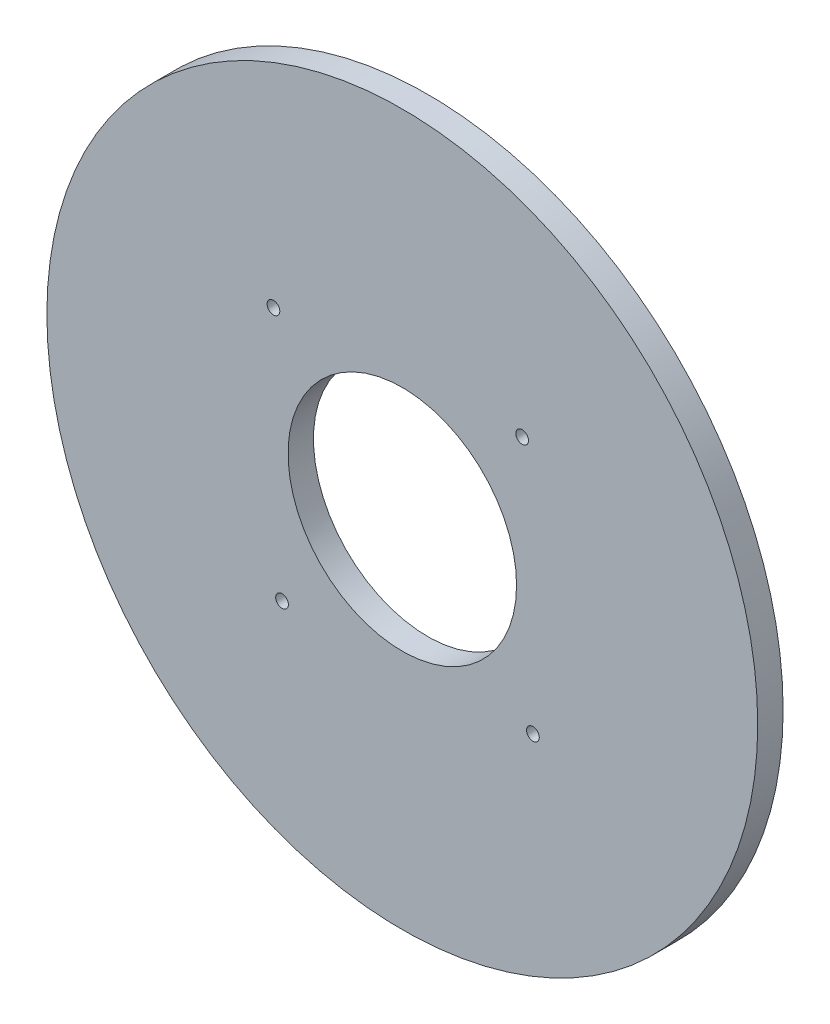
ISO-10303-21;
HEADER;
FILE_DESCRIPTION(('STEP AP214'),'2;1');
FILE_NAME('part.step','',(''),(''),'','','');
FILE_SCHEMA(('AUTOMOTIVE_DESIGN { 1 0 10303 214 1 1 1 1 }'));
ENDSEC;
DATA;
#1=APPLICATION_CONTEXT('core data for automotive mechanical design processes');
#2=APPLICATION_PROTOCOL_DEFINITION('international standard','automotive_design',2000,#1);
#3=PRODUCT_CONTEXT('',#1,'mechanical');
#4=PRODUCT('Part','Part','',(#3));
#5=PRODUCT_RELATED_PRODUCT_CATEGORY('part','',(#4));
#6=PRODUCT_DEFINITION_FORMATION('','',#4);
#7=PRODUCT_DEFINITION_CONTEXT('part definition',#1,'design');
#8=PRODUCT_DEFINITION('design','',#6,#7);
#9=PRODUCT_DEFINITION_SHAPE('','',#8);
#10=(LENGTH_UNIT() NAMED_UNIT(*) SI_UNIT(.MILLI.,.METRE.));
#11=(NAMED_UNIT(*) PLANE_ANGLE_UNIT() SI_UNIT($,.RADIAN.));
#12=(NAMED_UNIT(*) SI_UNIT($,.STERADIAN.) SOLID_ANGLE_UNIT());
#13=UNCERTAINTY_MEASURE_WITH_UNIT(LENGTH_MEASURE(1.E-05),#10,'distance_accuracy_value','');
#14=(GEOMETRIC_REPRESENTATION_CONTEXT(3) GLOBAL_UNCERTAINTY_ASSIGNED_CONTEXT((#13)) GLOBAL_UNIT_ASSIGNED_CONTEXT((#10,
#11,#12)) REPRESENTATION_CONTEXT('',''));
#15=CARTESIAN_POINT('',(0.,0.,0.));
#16=DIRECTION('',(0.,0.,1.));
#17=DIRECTION('',(1.,0.,0.));
#18=AXIS2_PLACEMENT_3D('',#15,#16,#17);
#19=CARTESIAN_POINT('',(0.,0.,6.35));
#20=DIRECTION('',(0.,0.,-1.));
#21=DIRECTION('',(-1.,0.,0.));
#22=AXIS2_PLACEMENT_3D('',#19,#20,#21);
#23=CYLINDRICAL_SURFACE('',#22,88.9);
#24=CARTESIAN_POINT('',(0.,0.,6.35));
#25=DIRECTION('',(0.,0.,1.));
#26=DIRECTION('',(1.,0.,0.));
#27=AXIS2_PLACEMENT_3D('',#24,#25,#26);
#28=CIRCLE('',#27,88.9);
#29=CARTESIAN_POINT('',(88.9,0.,6.35));
#30=VERTEX_POINT('',#29);
#31=EDGE_CURVE('E10',#30,#30,#28,.T.);
#32=ORIENTED_EDGE('',*,*,#31,.F.);
#33=EDGE_LOOP('',(#32));
#34=FACE_BOUND('',#33,.T.);
#35=CARTESIAN_POINT('',(0.,0.,0.));
#36=DIRECTION('',(0.,0.,1.));
#37=DIRECTION('',(1.,0.,0.));
#38=AXIS2_PLACEMENT_3D('',#35,#36,#37);
#39=CIRCLE('',#38,88.9);
#40=CARTESIAN_POINT('',(88.9,0.,0.));
#41=VERTEX_POINT('',#40);
#42=EDGE_CURVE('E33',#41,#41,#39,.T.);
#43=ORIENTED_EDGE('',*,*,#42,.T.);
#44=EDGE_LOOP('',(#43));
#45=FACE_BOUND('',#44,.T.);
#46=ADVANCED_FACE('F30',(#34,#45),#23,.T.);
#47=CARTESIAN_POINT('',(0.,0.,6.35));
#48=DIRECTION('',(0.,0.,1.));
#49=DIRECTION('',(1.,0.,0.));
#50=AXIS2_PLACEMENT_3D('',#47,#48,#49);
#51=PLANE('',#50);
#52=CARTESIAN_POINT('',(29.9769221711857,32.8205215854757,6.35));
#53=DIRECTION('',(0.,0.,-1.));
#54=DIRECTION('',(-1.,0.,0.));
#55=AXIS2_PLACEMENT_3D('',#52,#53,#54);
#56=CIRCLE('',#55,1.5875);
#57=CARTESIAN_POINT('',(28.3894221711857,32.8205215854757,6.35));
#58=VERTEX_POINT('',#57);
#59=EDGE_CURVE('E63',#58,#58,#56,.T.);
#60=ORIENTED_EDGE('',*,*,#59,.T.);
#61=EDGE_LOOP('',(#60));
#62=FACE_BOUND('',#61,.T.);
#63=CARTESIAN_POINT('',(32.6738609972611,-30.1367102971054,6.35));
#64=DIRECTION('',(0.,0.,-1.));
#65=DIRECTION('',(-1.,0.,0.));
#66=AXIS2_PLACEMENT_3D('',#63,#64,#65);
#67=CIRCLE('',#66,1.5875);
#68=CARTESIAN_POINT('',(31.0863609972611,-30.1367102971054,6.35));
#69=VERTEX_POINT('',#68);
#70=EDGE_CURVE('E57',#69,#69,#67,.T.);
#71=ORIENTED_EDGE('',*,*,#70,.T.);
#72=EDGE_LOOP('',(#71));
#73=FACE_BOUND('',#72,.T.);
#74=CARTESIAN_POINT('',(-30.0850826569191,-32.7214043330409,6.35));
#75=DIRECTION('',(0.,0.,-1.));
#76=DIRECTION('',(-1.,0.,0.));
#77=AXIS2_PLACEMENT_3D('',#74,#75,#76);
#78=CIRCLE('',#77,1.5875);
#79=CARTESIAN_POINT('',(-31.6725826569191,-32.7214043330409,6.35));
#80=VERTEX_POINT('',#79);
#81=EDGE_CURVE('E51',#80,#80,#78,.T.);
#82=ORIENTED_EDGE('',*,*,#81,.T.);
#83=EDGE_LOOP('',(#82));
#84=FACE_BOUND('',#83,.T.);
#85=CARTESIAN_POINT('',(-32.229029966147,29.7378972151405,6.35));
#86=DIRECTION('',(0.,0.,-1.));
#87=DIRECTION('',(-1.,0.,0.));
#88=AXIS2_PLACEMENT_3D('',#85,#86,#87);
#89=CIRCLE('',#88,1.5875);
#90=CARTESIAN_POINT('',(-33.816529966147,29.7378972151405,6.35));
#91=VERTEX_POINT('',#90);
#92=EDGE_CURVE('E45',#91,#91,#89,.T.);
#93=ORIENTED_EDGE('',*,*,#92,.T.);
#94=EDGE_LOOP('',(#93));
#95=FACE_BOUND('',#94,.T.);
#96=CARTESIAN_POINT('',(0.,0.,6.35));
#97=DIRECTION('',(0.,0.,1.));
#98=DIRECTION('',(1.,0.,0.));
#99=AXIS2_PLACEMENT_3D('',#96,#97,#98);
#100=CIRCLE('',#99,28.575);
#101=CARTESIAN_POINT('',(28.575,0.,6.35));
#102=VERTEX_POINT('',#101);
#103=EDGE_CURVE('E42',#102,#102,#100,.T.);
#104=ORIENTED_EDGE('',*,*,#103,.F.);
#105=EDGE_LOOP('',(#104));
#106=FACE_BOUND('',#105,.T.);
#107=ORIENTED_EDGE('',*,*,#31,.T.);
#108=EDGE_LOOP('',(#107));
#109=FACE_BOUND('',#108,.T.);
#110=ADVANCED_FACE('F72',(#62,#73,#84,#95,#106,#109),#51,.T.);
#111=CARTESIAN_POINT('',(0.,0.,0.));
#112=DIRECTION('',(0.,0.,1.));
#113=DIRECTION('',(1.,0.,0.));
#114=AXIS2_PLACEMENT_3D('',#111,#112,#113);
#115=PLANE('',#114);
#116=CARTESIAN_POINT('',(29.9769221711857,32.8205215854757,0.));
#117=DIRECTION('',(0.,0.,-1.));
#118=DIRECTION('',(-1.,0.,0.));
#119=AXIS2_PLACEMENT_3D('',#116,#117,#118);
#120=CIRCLE('',#119,1.5875);
#121=CARTESIAN_POINT('',(28.3894221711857,32.8205215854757,0.));
#122=VERTEX_POINT('',#121);
#123=EDGE_CURVE('E66',#122,#122,#120,.T.);
#124=ORIENTED_EDGE('',*,*,#123,.F.);
#125=EDGE_LOOP('',(#124));
#126=FACE_BOUND('',#125,.T.);
#127=CARTESIAN_POINT('',(32.6738609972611,-30.1367102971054,0.));
#128=DIRECTION('',(0.,0.,-1.));
#129=DIRECTION('',(-1.,0.,0.));
#130=AXIS2_PLACEMENT_3D('',#127,#128,#129);
#131=CIRCLE('',#130,1.5875);
#132=CARTESIAN_POINT('',(31.0863609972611,-30.1367102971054,0.));
#133=VERTEX_POINT('',#132);
#134=EDGE_CURVE('E60',#133,#133,#131,.T.);
#135=ORIENTED_EDGE('',*,*,#134,.F.);
#136=EDGE_LOOP('',(#135));
#137=FACE_BOUND('',#136,.T.);
#138=CARTESIAN_POINT('',(-30.0850826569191,-32.7214043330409,0.));
#139=DIRECTION('',(0.,0.,-1.));
#140=DIRECTION('',(-1.,0.,0.));
#141=AXIS2_PLACEMENT_3D('',#138,#139,#140);
#142=CIRCLE('',#141,1.5875);
#143=CARTESIAN_POINT('',(-31.6725826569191,-32.7214043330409,0.));
#144=VERTEX_POINT('',#143);
#145=EDGE_CURVE('E54',#144,#144,#142,.T.);
#146=ORIENTED_EDGE('',*,*,#145,.F.);
#147=EDGE_LOOP('',(#146));
#148=FACE_BOUND('',#147,.T.);
#149=CARTESIAN_POINT('',(-32.229029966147,29.7378972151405,0.));
#150=DIRECTION('',(0.,0.,-1.));
#151=DIRECTION('',(-1.,0.,0.));
#152=AXIS2_PLACEMENT_3D('',#149,#150,#151);
#153=CIRCLE('',#152,1.5875);
#154=CARTESIAN_POINT('',(-33.816529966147,29.7378972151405,0.));
#155=VERTEX_POINT('',#154);
#156=EDGE_CURVE('E48',#155,#155,#153,.T.);
#157=ORIENTED_EDGE('',*,*,#156,.F.);
#158=EDGE_LOOP('',(#157));
#159=FACE_BOUND('',#158,.T.);
#160=CARTESIAN_POINT('',(0.,0.,0.));
#161=DIRECTION('',(0.,0.,1.));
#162=DIRECTION('',(1.,0.,0.));
#163=AXIS2_PLACEMENT_3D('',#160,#161,#162);
#164=CIRCLE('',#163,28.575);
#165=CARTESIAN_POINT('',(28.575,0.,0.));
#166=VERTEX_POINT('',#165);
#167=EDGE_CURVE('E40',#166,#166,#164,.T.);
#168=ORIENTED_EDGE('',*,*,#167,.T.);
#169=EDGE_LOOP('',(#168));
#170=FACE_BOUND('',#169,.T.);
#171=ORIENTED_EDGE('',*,*,#42,.F.);
#172=EDGE_LOOP('',(#171));
#173=FACE_BOUND('',#172,.T.);
#174=ADVANCED_FACE('F82',(#126,#137,#148,#159,#170,#173),#115,.F.);
#175=CARTESIAN_POINT('',(0.,0.,0.));
#176=DIRECTION('',(0.,0.,1.));
#177=DIRECTION('',(1.,0.,0.));
#178=AXIS2_PLACEMENT_3D('',#175,#176,#177);
#179=CYLINDRICAL_SURFACE('',#178,28.575);
#180=ORIENTED_EDGE('',*,*,#167,.F.);
#181=EDGE_LOOP('',(#180));
#182=FACE_BOUND('',#181,.T.);
#183=ORIENTED_EDGE('',*,*,#103,.T.);
#184=EDGE_LOOP('',(#183));
#185=FACE_BOUND('',#184,.T.);
#186=ADVANCED_FACE('F85',(#182,#185),#179,.F.);
#187=CARTESIAN_POINT('',(-32.229029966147,29.7378972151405,6.35));
#188=DIRECTION('',(0.,0.,-1.));
#189=DIRECTION('',(-1.,0.,0.));
#190=AXIS2_PLACEMENT_3D('',#187,#188,#189);
#191=CYLINDRICAL_SURFACE('',#190,1.5875);
#192=ORIENTED_EDGE('',*,*,#92,.F.);
#193=EDGE_LOOP('',(#192));
#194=FACE_BOUND('',#193,.T.);
#195=ORIENTED_EDGE('',*,*,#156,.T.);
#196=EDGE_LOOP('',(#195));
#197=FACE_BOUND('',#196,.T.);
#198=ADVANCED_FACE('F107',(#194,#197),#191,.F.);
#199=CARTESIAN_POINT('',(-30.0850826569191,-32.7214043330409,6.35));
#200=DIRECTION('',(0.,0.,-1.));
#201=DIRECTION('',(-1.,0.,0.));
#202=AXIS2_PLACEMENT_3D('',#199,#200,#201);
#203=CYLINDRICAL_SURFACE('',#202,1.5875);
#204=ORIENTED_EDGE('',*,*,#81,.F.);
#205=EDGE_LOOP('',(#204));
#206=FACE_BOUND('',#205,.T.);
#207=ORIENTED_EDGE('',*,*,#145,.T.);
#208=EDGE_LOOP('',(#207));
#209=FACE_BOUND('',#208,.T.);
#210=ADVANCED_FACE('F111',(#206,#209),#203,.F.);
#211=CARTESIAN_POINT('',(32.6738609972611,-30.1367102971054,6.35));
#212=DIRECTION('',(0.,0.,-1.));
#213=DIRECTION('',(-1.,0.,0.));
#214=AXIS2_PLACEMENT_3D('',#211,#212,#213);
#215=CYLINDRICAL_SURFACE('',#214,1.5875);
#216=ORIENTED_EDGE('',*,*,#70,.F.);
#217=EDGE_LOOP('',(#216));
#218=FACE_BOUND('',#217,.T.);
#219=ORIENTED_EDGE('',*,*,#134,.T.);
#220=EDGE_LOOP('',(#219));
#221=FACE_BOUND('',#220,.T.);
#222=ADVANCED_FACE('F78',(#218,#221),#215,.F.);
#223=CARTESIAN_POINT('',(29.9769221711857,32.8205215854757,6.35));
#224=DIRECTION('',(0.,0.,-1.));
#225=DIRECTION('',(-1.,0.,0.));
#226=AXIS2_PLACEMENT_3D('',#223,#224,#225);
#227=CYLINDRICAL_SURFACE('',#226,1.5875);
#228=ORIENTED_EDGE('',*,*,#59,.F.);
#229=EDGE_LOOP('',(#228));
#230=FACE_BOUND('',#229,.T.);
#231=ORIENTED_EDGE('',*,*,#123,.T.);
#232=EDGE_LOOP('',(#231));
#233=FACE_BOUND('',#232,.T.);
#234=ADVANCED_FACE('F75',(#230,#233),#227,.F.);
#235=CLOSED_SHELL('',(#46,#110,#174,#186,#198,#210,#222,#234));
#236=MANIFOLD_SOLID_BREP('B2',#235);
#237=ADVANCED_BREP_SHAPE_REPRESENTATION('',(#18,#236),#14);
#238=SHAPE_DEFINITION_REPRESENTATION(#9,#237);
ENDSEC;
END-ISO-10303-21;
